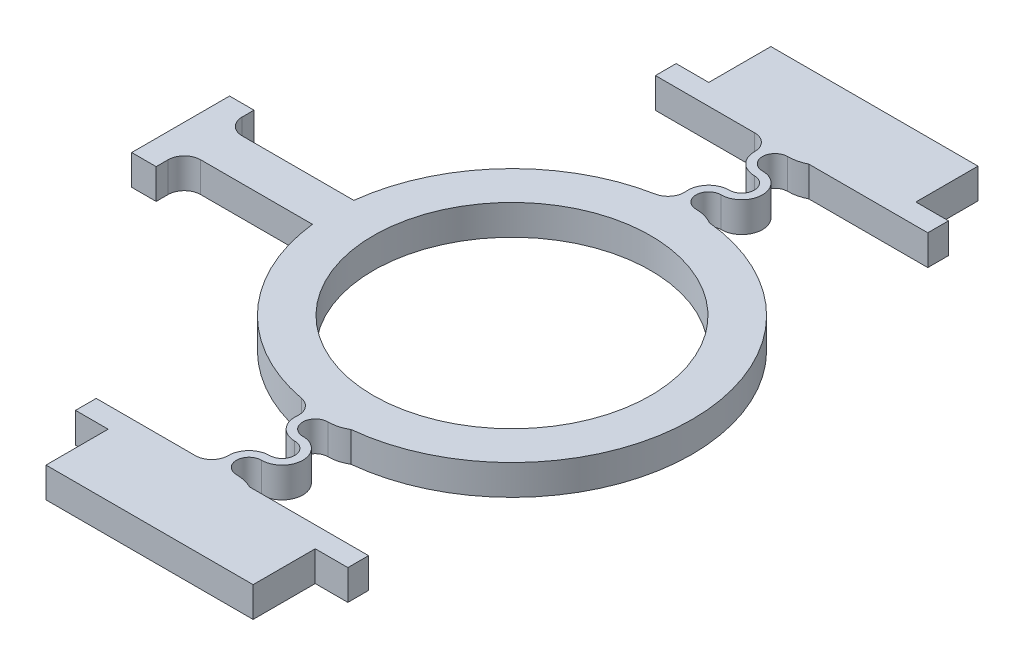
from build123d import *

# Parameters (mm, degrees)
SKETCH2_R           = 8.5
BOSS_EXTRUDE1_DEPTH = 0.925
BOSS_EXTRUDE4_DEPTH = 1.85
FILLET3_R           = 1
SKETCH5_W           = 16.7
SKETCH5_H           = 1.27
BOSS_EXTRUDE3_DEPTH = 1.85
SKETCH8_W           = 1.5
SKETCH8_H           = 6
BOSS_EXTRUDE5_DEPTH = 1.85
FILLET4_R           = 1


with BuildPart() as part:
    # Sketch2 → Boss-Extrude1 (new, symmetric)
    with BuildSketch(Plane(origin=(0, 0, 0), x_dir=(1, 0, 0), z_dir=(0, 1, 0))):
        with BuildLine():
            Line((-10.966708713, 1.27), (-20.32, 1.27))
            Line((-20.32, 1.27), (-20.32, -1.27))
            Line((-20.32, -1.27), (-10.966708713, -1.27))
            ThreePointArc((-10.966708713, -1.27), (11.04, 0), (-10.966708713, 1.27))
        make_face()
        with Locations(Location((0, 0, 0), (0, 0, 270))):
            Circle(SKETCH2_R, mode=Mode.SUBTRACT)
    extrude(amount=BOSS_EXTRUDE1_DEPTH, both=True)

    # Sketch7 → Boss-Extrude4 (add)
    with BuildSketch(Plane(origin=(0, 0.925, 0), x_dir=(1, 0, 0), z_dir=(0, 1, 0))):
        with BuildLine():
            Line((1.05437792, 17.145), (6.35, 17.145))
            Line((6.35, 17.145), (6.35, 22.225))
            Line((6.35, 22.225), (-6.35, 22.225))
            Line((-6.35, 22.225), (-6.35, 17.145))
            Line((-6.35, 17.145), (-0.755810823, 17.145))
            ThreePointArc((-0.755810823, 17.145), (-1.203378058, 15.729457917), (0, 14.86))
            ThreePointArc((0, 14.86), (0.7675, 14.0925), (0, 13.325))
            ThreePointArc((0, 13.325), (-1.20959968, 12.436214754), (-0.722829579, 11.016311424))
            ThreePointArc((-0.722829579, 11.016311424), (0.197078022, 11.038240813), (1.115616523, 10.983487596))
            ThreePointArc((1.115616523, 10.983487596), (0.578478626, 11.211977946), (0, 11.29))
            ThreePointArc((0, 11.29), (-0.7675, 12.0575), (0, 12.825))
            ThreePointArc((0, 12.825), (1.2675, 14.0925), (0, 15.36))
            ThreePointArc((0, 15.36), (-0.7675, 16.1275), (0, 16.895))
            ThreePointArc((0, 16.895), (0.5418055, 16.958354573), (1.05437792, 17.145))
        make_face()
    boss_extrude4 = extrude(amount=-BOSS_EXTRUDE4_DEPTH)

    # Mirror2: Boss-Extrude4 across plane
    add(boss_extrude4.mirror(Plane.XY))

    # Fillet3
    fillet3_edges = [part.edges().sort_by_distance(p)[0] for p in [
        (-0.722829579, 0, -11.016311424),
        (-0.755810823, 0, -17.145),
        (-0.722829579, 0, 11.016311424),
        (-0.755810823, 0, 17.145),
    ]]
    fillet(fillet3_edges, radius=FILLET3_R)

    # Sketch5 → Boss-Extrude3 (add)
    with BuildSketch(Plane(origin=(0, 0.925, 0), x_dir=(1, 0, 0), z_dir=(0, 1, 0))):
        with Locations((0, 17.78)):
            Rectangle(SKETCH5_W, SKETCH5_H)
    boss_extrude3 = extrude(amount=-BOSS_EXTRUDE3_DEPTH)

    # Mirror1: Boss-Extrude3 across plane
    add(boss_extrude3.mirror(Plane.XY))

    # Sketch8 → Boss-Extrude5 (add)
    with BuildSketch(Plane(origin=(0, 0.925, 0), x_dir=(1, 0, 0), z_dir=(0, 1, 0))):
        with Locations((-19.57, 0)):
            Rectangle(SKETCH8_W, SKETCH8_H)
    extrude(amount=-BOSS_EXTRUDE5_DEPTH)

    # Fillet4
    fillet4_edges = [part.edges().sort_by_distance(p)[0] for p in [
        (-18.82, 0, -1.27),
        (-18.82, 0, 1.27),
    ]]
    fillet(fillet4_edges, radius=FILLET4_R)


solid = part.part
